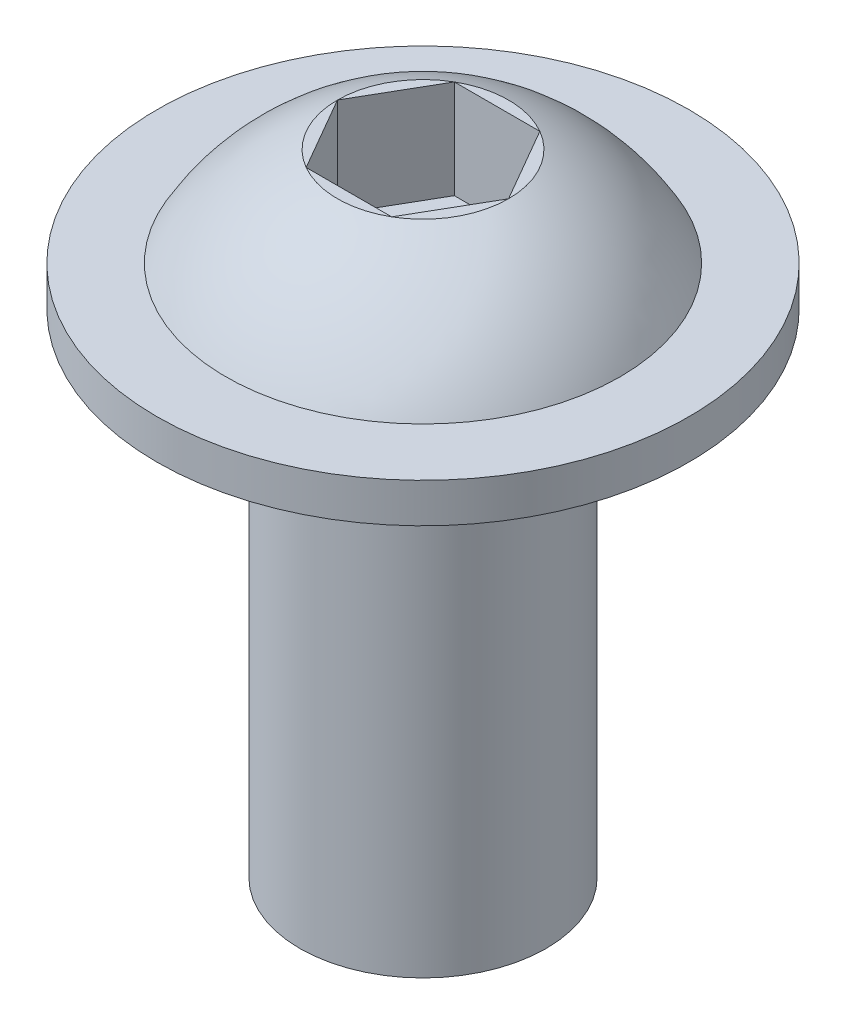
ISO-10303-21;
HEADER;
FILE_DESCRIPTION(('STEP AP214'),'2;1');
FILE_NAME('part.step','',(''),(''),'','','');
FILE_SCHEMA(('AUTOMOTIVE_DESIGN { 1 0 10303 214 1 1 1 1 }'));
ENDSEC;
DATA;
#1=APPLICATION_CONTEXT('core data for automotive mechanical design processes');
#2=APPLICATION_PROTOCOL_DEFINITION('international standard','automotive_design',2000,#1);
#3=PRODUCT_CONTEXT('',#1,'mechanical');
#4=PRODUCT('Part','Part','',(#3));
#5=PRODUCT_RELATED_PRODUCT_CATEGORY('part','',(#4));
#6=PRODUCT_DEFINITION_FORMATION('','',#4);
#7=PRODUCT_DEFINITION_CONTEXT('part definition',#1,'design');
#8=PRODUCT_DEFINITION('design','',#6,#7);
#9=PRODUCT_DEFINITION_SHAPE('','',#8);
#10=(LENGTH_UNIT() NAMED_UNIT(*) SI_UNIT(.MILLI.,.METRE.));
#11=(NAMED_UNIT(*) PLANE_ANGLE_UNIT() SI_UNIT($,.RADIAN.));
#12=(NAMED_UNIT(*) SI_UNIT($,.STERADIAN.) SOLID_ANGLE_UNIT());
#13=UNCERTAINTY_MEASURE_WITH_UNIT(LENGTH_MEASURE(1.E-05),#10,'distance_accuracy_value','');
#14=(GEOMETRIC_REPRESENTATION_CONTEXT(3) GLOBAL_UNCERTAINTY_ASSIGNED_CONTEXT((#13)) GLOBAL_UNIT_ASSIGNED_CONTEXT((#10,
#11,#12)) REPRESENTATION_CONTEXT('',''));
#15=CARTESIAN_POINT('',(0.,0.,0.));
#16=DIRECTION('',(0.,0.,1.));
#17=DIRECTION('',(1.,0.,0.));
#18=AXIS2_PLACEMENT_3D('',#15,#16,#17);
#19=CARTESIAN_POINT('',(2.7569630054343,20.32,0.));
#20=DIRECTION('',(0.,1.,0.));
#21=DIRECTION('',(0.,0.,1.));
#22=AXIS2_PLACEMENT_3D('',#19,#20,#21);
#23=PLANE('',#22);
#24=DIRECTION('',(0.5,0.,-0.866025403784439));
#25=VECTOR('',#24,1.);
#26=CARTESIAN_POINT('',(1.37848150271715,20.32,2.3876));
#27=LINE('',#26,#25);
#28=CARTESIAN_POINT('',(1.37848150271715,20.32,2.3876));
#29=VERTEX_POINT('',#28);
#30=CARTESIAN_POINT('',(2.7569630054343,20.32,0.));
#31=VERTEX_POINT('',#30);
#32=EDGE_CURVE('E48',#29,#31,#27,.T.);
#33=ORIENTED_EDGE('',*,*,#32,.F.);
#34=CARTESIAN_POINT('',(0.,20.32,0.));
#35=DIRECTION('',(0.,-1.,0.));
#36=DIRECTION('',(0.,0.,-1.));
#37=AXIS2_PLACEMENT_3D('',#34,#35,#36);
#38=CIRCLE('',#37,2.7569630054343);
#39=EDGE_CURVE('E145',#31,#29,#38,.T.);
#40=ORIENTED_EDGE('',*,*,#39,.F.);
#41=EDGE_LOOP('',(#33,#40));
#42=FACE_BOUND('',#41,.T.);
#43=ADVANCED_FACE('F33',(#42),#23,.T.);
#44=DIRECTION('',(1.,0.,0.));
#45=VECTOR('',#44,1.);
#46=CARTESIAN_POINT('',(-1.37848150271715,20.32,2.3876));
#47=LINE('',#46,#45);
#48=CARTESIAN_POINT('',(-1.37848150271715,20.32,2.3876));
#49=VERTEX_POINT('',#48);
#50=EDGE_CURVE('E131',#49,#29,#47,.T.);
#51=ORIENTED_EDGE('',*,*,#50,.F.);
#52=EDGE_CURVE('E219',#29,#49,#38,.T.);
#53=ORIENTED_EDGE('',*,*,#52,.F.);
#54=EDGE_LOOP('',(#51,#53));
#55=FACE_BOUND('',#54,.T.);
#56=ADVANCED_FACE('F172',(#55),#23,.T.);
#57=DIRECTION('',(0.5,0.,0.866025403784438));
#58=VECTOR('',#57,1.);
#59=CARTESIAN_POINT('',(-2.7569630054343,20.32,0.));
#60=LINE('',#59,#58);
#61=CARTESIAN_POINT('',(-2.7569630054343,20.32,0.));
#62=VERTEX_POINT('',#61);
#63=EDGE_CURVE('E129',#62,#49,#60,.T.);
#64=ORIENTED_EDGE('',*,*,#63,.F.);
#65=EDGE_CURVE('E220',#49,#62,#38,.T.);
#66=ORIENTED_EDGE('',*,*,#65,.F.);
#67=EDGE_LOOP('',(#64,#66));
#68=FACE_BOUND('',#67,.T.);
#69=ADVANCED_FACE('F179',(#68),#23,.T.);
#70=DIRECTION('',(-0.499999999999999,0.,0.866025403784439));
#71=VECTOR('',#70,1.);
#72=CARTESIAN_POINT('',(-1.37848150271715,20.32,-2.3876));
#73=LINE('',#72,#71);
#74=CARTESIAN_POINT('',(-1.37848150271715,20.32,-2.3876));
#75=VERTEX_POINT('',#74);
#76=EDGE_CURVE('E96',#75,#62,#73,.T.);
#77=ORIENTED_EDGE('',*,*,#76,.F.);
#78=EDGE_CURVE('E214',#62,#75,#38,.T.);
#79=ORIENTED_EDGE('',*,*,#78,.F.);
#80=EDGE_LOOP('',(#77,#79));
#81=FACE_BOUND('',#80,.T.);
#82=ADVANCED_FACE('F196',(#81),#23,.T.);
#83=DIRECTION('',(-1.,0.,0.));
#84=VECTOR('',#83,1.);
#85=CARTESIAN_POINT('',(1.37848150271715,20.32,-2.3876));
#86=LINE('',#85,#84);
#87=CARTESIAN_POINT('',(1.37848150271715,20.32,-2.3876));
#88=VERTEX_POINT('',#87);
#89=EDGE_CURVE('E125',#88,#75,#86,.T.);
#90=ORIENTED_EDGE('',*,*,#89,.F.);
#91=EDGE_CURVE('E135',#75,#88,#38,.T.);
#92=ORIENTED_EDGE('',*,*,#91,.F.);
#93=EDGE_LOOP('',(#90,#92));
#94=FACE_BOUND('',#93,.T.);
#95=ADVANCED_FACE('F187',(#94),#23,.T.);
#96=CARTESIAN_POINT('',(0.,0.,0.));
#97=DIRECTION('',(0.,-1.,0.));
#98=DIRECTION('',(0.,0.,-1.));
#99=AXIS2_PLACEMENT_3D('',#96,#97,#98);
#100=PLANE('',#99);
#101=CARTESIAN_POINT('',(0.,0.,0.));
#102=DIRECTION('',(0.,-1.,0.));
#103=DIRECTION('',(0.,0.,-1.));
#104=AXIS2_PLACEMENT_3D('',#101,#102,#103);
#105=CIRCLE('',#104,3.96875);
#106=CARTESIAN_POINT('',(0.,0.,-3.96875));
#107=VERTEX_POINT('',#106);
#108=EDGE_CURVE('E11',#107,#107,#105,.T.);
#109=ORIENTED_EDGE('',*,*,#108,.T.);
#110=EDGE_LOOP('',(#109));
#111=FACE_BOUND('',#110,.T.);
#112=ADVANCED_FACE('F35',(#111),#100,.T.);
#113=CARTESIAN_POINT('',(0.,0.,0.));
#114=DIRECTION('',(0.,-1.,0.));
#115=DIRECTION('',(0.,0.,-1.));
#116=AXIS2_PLACEMENT_3D('',#113,#114,#115);
#117=CYLINDRICAL_SURFACE('',#116,3.96875);
#118=CARTESIAN_POINT('',(0.,15.875,0.));
#119=DIRECTION('',(0.,-1.,0.));
#120=DIRECTION('',(0.,0.,-1.));
#121=AXIS2_PLACEMENT_3D('',#118,#119,#120);
#122=CIRCLE('',#121,3.96875);
#123=CARTESIAN_POINT('',(0.,15.875,-3.96875));
#124=VERTEX_POINT('',#123);
#125=EDGE_CURVE('E41',#124,#124,#122,.T.);
#126=ORIENTED_EDGE('',*,*,#125,.T.);
#127=EDGE_LOOP('',(#126));
#128=FACE_BOUND('',#127,.T.);
#129=ORIENTED_EDGE('',*,*,#108,.F.);
#130=EDGE_LOOP('',(#129));
#131=FACE_BOUND('',#130,.T.);
#132=ADVANCED_FACE('F156',(#128,#131),#117,.T.);
#133=CARTESIAN_POINT('',(3.96875,15.875,0.));
#134=DIRECTION('',(0.,-1.,0.));
#135=DIRECTION('',(0.,0.,-1.));
#136=AXIS2_PLACEMENT_3D('',#133,#134,#135);
#137=PLANE('',#136);
#138=CARTESIAN_POINT('',(0.,15.875,0.));
#139=DIRECTION('',(0.,-1.,0.));
#140=DIRECTION('',(0.,0.,-1.));
#141=AXIS2_PLACEMENT_3D('',#138,#139,#140);
#142=CIRCLE('',#141,8.5725);
#143=CARTESIAN_POINT('',(0.,15.875,-8.5725));
#144=VERTEX_POINT('',#143);
#145=EDGE_CURVE('E151',#144,#144,#142,.T.);
#146=ORIENTED_EDGE('',*,*,#145,.T.);
#147=EDGE_LOOP('',(#146));
#148=FACE_BOUND('',#147,.T.);
#149=ORIENTED_EDGE('',*,*,#125,.F.);
#150=EDGE_LOOP('',(#149));
#151=FACE_BOUND('',#150,.T.);
#152=ADVANCED_FACE('F159',(#148,#151),#137,.T.);
#153=CARTESIAN_POINT('',(0.,0.,0.));
#154=DIRECTION('',(0.,-1.,0.));
#155=DIRECTION('',(0.,0.,-1.));
#156=AXIS2_PLACEMENT_3D('',#153,#154,#155);
#157=CYLINDRICAL_SURFACE('',#156,8.5725);
#158=CARTESIAN_POINT('',(0.,17.145,0.));
#159=DIRECTION('',(0.,-1.,0.));
#160=DIRECTION('',(0.,0.,-1.));
#161=AXIS2_PLACEMENT_3D('',#158,#159,#160);
#162=CIRCLE('',#161,8.5725);
#163=CARTESIAN_POINT('',(0.,17.145,-8.5725));
#164=VERTEX_POINT('',#163);
#165=EDGE_CURVE('E148',#164,#164,#162,.T.);
#166=ORIENTED_EDGE('',*,*,#165,.T.);
#167=EDGE_LOOP('',(#166));
#168=FACE_BOUND('',#167,.T.);
#169=ORIENTED_EDGE('',*,*,#145,.F.);
#170=EDGE_LOOP('',(#169));
#171=FACE_BOUND('',#170,.T.);
#172=ADVANCED_FACE('F161',(#168,#171),#157,.T.);
#173=CARTESIAN_POINT('',(8.5725,17.145,0.));
#174=DIRECTION('',(0.,1.,0.));
#175=DIRECTION('',(0.,0.,1.));
#176=AXIS2_PLACEMENT_3D('',#173,#174,#175);
#177=PLANE('',#176);
#178=CARTESIAN_POINT('',(0.,17.145,0.));
#179=DIRECTION('',(0.,-1.,0.));
#180=DIRECTION('',(0.,0.,-1.));
#181=AXIS2_PLACEMENT_3D('',#178,#179,#180);
#182=CIRCLE('',#181,6.35);
#183=CARTESIAN_POINT('',(0.,17.145,-6.35));
#184=VERTEX_POINT('',#183);
#185=EDGE_CURVE('E144',#184,#184,#182,.T.);
#186=ORIENTED_EDGE('',*,*,#185,.T.);
#187=EDGE_LOOP('',(#186));
#188=FACE_BOUND('',#187,.T.);
#189=ORIENTED_EDGE('',*,*,#165,.F.);
#190=EDGE_LOOP('',(#189));
#191=FACE_BOUND('',#190,.T.);
#192=ADVANCED_FACE('F168',(#188,#191),#177,.T.);
#193=CARTESIAN_POINT('',(0.,13.5794834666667,0.));
#194=DIRECTION('',(0.,-1.,0.));
#195=DIRECTION('',(1.,0.,0.));
#196=AXIS2_PLACEMENT_3D('',#193,#194,#195);
#197=SPHERICAL_SURFACE('',#196,7.282541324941);
#198=EDGE_CURVE('E141',#88,#31,#38,.T.);
#199=ORIENTED_EDGE('',*,*,#198,.T.);
#200=ORIENTED_EDGE('',*,*,#39,.T.);
#201=ORIENTED_EDGE('',*,*,#52,.T.);
#202=ORIENTED_EDGE('',*,*,#65,.T.);
#203=ORIENTED_EDGE('',*,*,#78,.T.);
#204=ORIENTED_EDGE('',*,*,#91,.T.);
#205=EDGE_LOOP('',(#199,#200,#201,#202,#203,#204));
#206=FACE_BOUND('',#205,.T.);
#207=ORIENTED_EDGE('',*,*,#185,.F.);
#208=EDGE_LOOP('',(#207));
#209=FACE_BOUND('',#208,.T.);
#210=ADVANCED_FACE('F185',(#206,#209),#197,.T.);
#211=DIRECTION('',(-0.5,0.,-0.866025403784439));
#212=VECTOR('',#211,1.);
#213=CARTESIAN_POINT('',(2.7569630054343,20.32,0.));
#214=LINE('',#213,#212);
#215=EDGE_CURVE('E122',#31,#88,#214,.T.);
#216=ORIENTED_EDGE('',*,*,#215,.F.);
#217=ORIENTED_EDGE('',*,*,#198,.F.);
#218=EDGE_LOOP('',(#216,#217));
#219=FACE_BOUND('',#218,.T.);
#220=ADVANCED_FACE('F175',(#219),#23,.T.);
#221=CARTESIAN_POINT('',(1.37848150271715,17.145,2.3876));
#222=DIRECTION('',(0.866025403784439,0.,0.5));
#223=DIRECTION('',(0.5,0.,-0.866025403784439));
#224=AXIS2_PLACEMENT_3D('',#221,#222,#223);
#225=PLANE('',#224);
#226=ORIENTED_EDGE('',*,*,#32,.T.);
#227=DIRECTION('',(0.,1.,0.));
#228=VECTOR('',#227,1.);
#229=CARTESIAN_POINT('',(2.7569630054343,17.145,0.));
#230=LINE('',#229,#228);
#231=CARTESIAN_POINT('',(2.7569630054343,17.145,0.));
#232=VERTEX_POINT('',#231);
#233=EDGE_CURVE('E78',#232,#31,#230,.T.);
#234=ORIENTED_EDGE('',*,*,#233,.F.);
#235=DIRECTION('',(0.5,0.,-0.866025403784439));
#236=VECTOR('',#235,1.);
#237=CARTESIAN_POINT('',(1.37848150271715,17.145,2.3876));
#238=LINE('',#237,#236);
#239=CARTESIAN_POINT('',(1.37848150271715,17.145,2.3876));
#240=VERTEX_POINT('',#239);
#241=EDGE_CURVE('E133',#240,#232,#238,.T.);
#242=ORIENTED_EDGE('',*,*,#241,.F.);
#243=DIRECTION('',(0.,1.,0.));
#244=VECTOR('',#243,1.);
#245=CARTESIAN_POINT('',(1.37848150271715,17.145,2.3876));
#246=LINE('',#245,#244);
#247=EDGE_CURVE('E56',#240,#29,#246,.T.);
#248=ORIENTED_EDGE('',*,*,#247,.T.);
#249=EDGE_LOOP('',(#226,#234,#242,#248));
#250=FACE_BOUND('',#249,.T.);
#251=ADVANCED_FACE('F184',(#250),#225,.F.);
#252=CARTESIAN_POINT('',(-1.37848150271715,17.145,2.3876));
#253=DIRECTION('',(0.,0.,1.));
#254=DIRECTION('',(1.,0.,0.));
#255=AXIS2_PLACEMENT_3D('',#252,#253,#254);
#256=PLANE('',#255);
#257=ORIENTED_EDGE('',*,*,#50,.T.);
#258=ORIENTED_EDGE('',*,*,#247,.F.);
#259=DIRECTION('',(1.,0.,0.));
#260=VECTOR('',#259,1.);
#261=CARTESIAN_POINT('',(-1.37848150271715,17.145,2.3876));
#262=LINE('',#261,#260);
#263=CARTESIAN_POINT('',(-1.37848150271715,17.145,2.3876));
#264=VERTEX_POINT('',#263);
#265=EDGE_CURVE('E108',#264,#240,#262,.T.);
#266=ORIENTED_EDGE('',*,*,#265,.F.);
#267=DIRECTION('',(0.,1.,0.));
#268=VECTOR('',#267,1.);
#269=CARTESIAN_POINT('',(-1.37848150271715,17.145,2.3876));
#270=LINE('',#269,#268);
#271=EDGE_CURVE('E100',#264,#49,#270,.T.);
#272=ORIENTED_EDGE('',*,*,#271,.T.);
#273=EDGE_LOOP('',(#257,#258,#266,#272));
#274=FACE_BOUND('',#273,.T.);
#275=ADVANCED_FACE('F192',(#274),#256,.F.);
#276=CARTESIAN_POINT('',(-2.7569630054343,17.145,0.));
#277=DIRECTION('',(-0.866025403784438,0.,0.5));
#278=DIRECTION('',(0.5,0.,0.866025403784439));
#279=AXIS2_PLACEMENT_3D('',#276,#277,#278);
#280=PLANE('',#279);
#281=ORIENTED_EDGE('',*,*,#63,.T.);
#282=ORIENTED_EDGE('',*,*,#271,.F.);
#283=DIRECTION('',(0.5,0.,0.866025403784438));
#284=VECTOR('',#283,1.);
#285=CARTESIAN_POINT('',(-2.7569630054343,17.145,0.));
#286=LINE('',#285,#284);
#287=CARTESIAN_POINT('',(-2.7569630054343,17.145,0.));
#288=VERTEX_POINT('',#287);
#289=EDGE_CURVE('E104',#288,#264,#286,.T.);
#290=ORIENTED_EDGE('',*,*,#289,.F.);
#291=DIRECTION('',(0.,1.,0.));
#292=VECTOR('',#291,1.);
#293=CARTESIAN_POINT('',(-2.7569630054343,17.145,0.));
#294=LINE('',#293,#292);
#295=EDGE_CURVE('E89',#288,#62,#294,.T.);
#296=ORIENTED_EDGE('',*,*,#295,.T.);
#297=EDGE_LOOP('',(#281,#282,#290,#296));
#298=FACE_BOUND('',#297,.T.);
#299=ADVANCED_FACE('F105',(#298),#280,.F.);
#300=CARTESIAN_POINT('',(-1.37848150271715,17.145,-2.3876));
#301=DIRECTION('',(-0.866025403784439,0.,-0.499999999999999));
#302=DIRECTION('',(-0.5,0.,0.866025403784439));
#303=AXIS2_PLACEMENT_3D('',#300,#301,#302);
#304=PLANE('',#303);
#305=ORIENTED_EDGE('',*,*,#76,.T.);
#306=ORIENTED_EDGE('',*,*,#295,.F.);
#307=DIRECTION('',(-0.499999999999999,0.,0.866025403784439));
#308=VECTOR('',#307,1.);
#309=CARTESIAN_POINT('',(-1.37848150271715,17.145,-2.3876));
#310=LINE('',#309,#308);
#311=CARTESIAN_POINT('',(-1.37848150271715,17.145,-2.3876));
#312=VERTEX_POINT('',#311);
#313=EDGE_CURVE('E93',#312,#288,#310,.T.);
#314=ORIENTED_EDGE('',*,*,#313,.F.);
#315=DIRECTION('',(0.,1.,0.));
#316=VECTOR('',#315,1.);
#317=CARTESIAN_POINT('',(-1.37848150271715,17.145,-2.3876));
#318=LINE('',#317,#316);
#319=EDGE_CURVE('E101',#312,#75,#318,.T.);
#320=ORIENTED_EDGE('',*,*,#319,.T.);
#321=EDGE_LOOP('',(#305,#306,#314,#320));
#322=FACE_BOUND('',#321,.T.);
#323=ADVANCED_FACE('F91',(#322),#304,.F.);
#324=CARTESIAN_POINT('',(1.37848150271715,17.145,-2.3876));
#325=DIRECTION('',(0.,0.,-1.));
#326=DIRECTION('',(-1.,0.,0.));
#327=AXIS2_PLACEMENT_3D('',#324,#325,#326);
#328=PLANE('',#327);
#329=ORIENTED_EDGE('',*,*,#89,.T.);
#330=ORIENTED_EDGE('',*,*,#319,.F.);
#331=DIRECTION('',(-1.,0.,0.));
#332=VECTOR('',#331,1.);
#333=CARTESIAN_POINT('',(1.37848150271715,17.145,-2.3876));
#334=LINE('',#333,#332);
#335=CARTESIAN_POINT('',(1.37848150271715,17.145,-2.3876));
#336=VERTEX_POINT('',#335);
#337=EDGE_CURVE('E114',#336,#312,#334,.T.);
#338=ORIENTED_EDGE('',*,*,#337,.F.);
#339=DIRECTION('',(0.,1.,0.));
#340=VECTOR('',#339,1.);
#341=CARTESIAN_POINT('',(1.37848150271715,17.145,-2.3876));
#342=LINE('',#341,#340);
#343=EDGE_CURVE('E138',#336,#88,#342,.T.);
#344=ORIENTED_EDGE('',*,*,#343,.T.);
#345=EDGE_LOOP('',(#329,#330,#338,#344));
#346=FACE_BOUND('',#345,.T.);
#347=ADVANCED_FACE('F226',(#346),#328,.F.);
#348=CARTESIAN_POINT('',(2.7569630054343,17.145,0.));
#349=DIRECTION('',(0.866025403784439,0.,-0.5));
#350=DIRECTION('',(-0.5,0.,-0.866025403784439));
#351=AXIS2_PLACEMENT_3D('',#348,#349,#350);
#352=PLANE('',#351);
#353=ORIENTED_EDGE('',*,*,#215,.T.);
#354=ORIENTED_EDGE('',*,*,#343,.F.);
#355=DIRECTION('',(-0.5,0.,-0.866025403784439));
#356=VECTOR('',#355,1.);
#357=CARTESIAN_POINT('',(2.7569630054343,17.145,0.));
#358=LINE('',#357,#356);
#359=EDGE_CURVE('E116',#232,#336,#358,.T.);
#360=ORIENTED_EDGE('',*,*,#359,.F.);
#361=ORIENTED_EDGE('',*,*,#233,.T.);
#362=EDGE_LOOP('',(#353,#354,#360,#361));
#363=FACE_BOUND('',#362,.T.);
#364=ADVANCED_FACE('F225',(#363),#352,.F.);
#365=CARTESIAN_POINT('',(4.13544450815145,17.145,-2.3876));
#366=DIRECTION('',(0.,1.,0.));
#367=DIRECTION('',(0.,0.,1.));
#368=AXIS2_PLACEMENT_3D('',#365,#366,#367);
#369=PLANE('',#368);
#370=ORIENTED_EDGE('',*,*,#241,.T.);
#371=ORIENTED_EDGE('',*,*,#359,.T.);
#372=ORIENTED_EDGE('',*,*,#337,.T.);
#373=ORIENTED_EDGE('',*,*,#313,.T.);
#374=ORIENTED_EDGE('',*,*,#289,.T.);
#375=ORIENTED_EDGE('',*,*,#265,.T.);
#376=EDGE_LOOP('',(#370,#371,#372,#373,#374,#375));
#377=FACE_BOUND('',#376,.T.);
#378=ADVANCED_FACE('F111',(#377),#369,.T.);
#379=CLOSED_SHELL('',(#43,#56,#69,#82,#95,#112,#132,#152,#172,#192,#210,#220,#251,#275,#299,
#323,#347,#364,#378));
#380=MANIFOLD_SOLID_BREP('B2',#379);
#381=ADVANCED_BREP_SHAPE_REPRESENTATION('',(#18,#380),#14);
#382=SHAPE_DEFINITION_REPRESENTATION(#9,#381);
ENDSEC;
END-ISO-10303-21;
